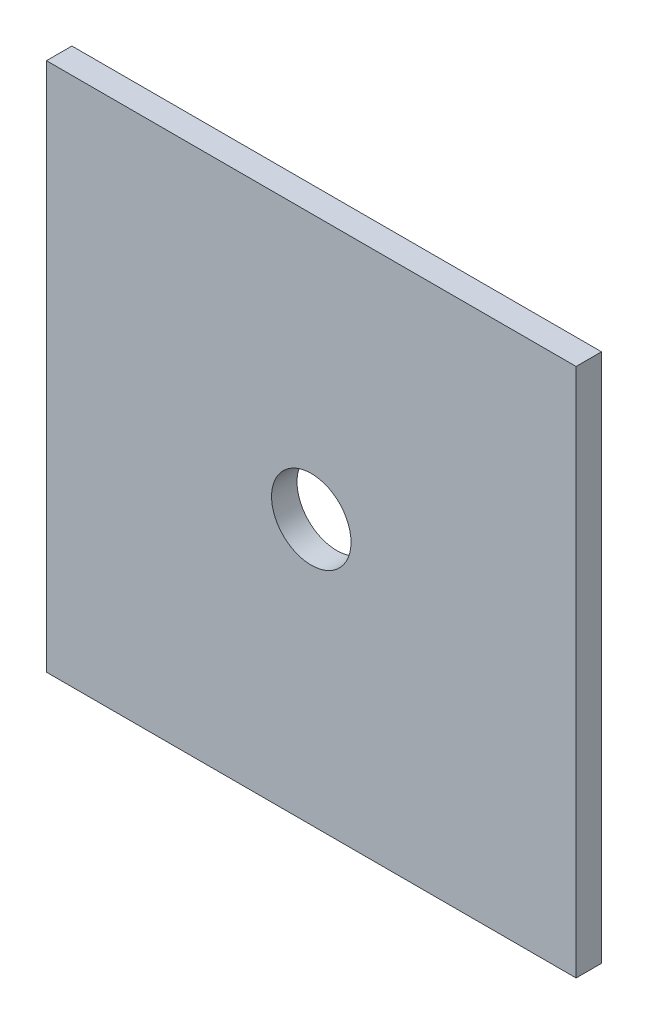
ISO-10303-21;
HEADER;
FILE_DESCRIPTION(('STEP AP214'),'2;1');
FILE_NAME('part.step','',(''),(''),'','','');
FILE_SCHEMA(('AUTOMOTIVE_DESIGN { 1 0 10303 214 1 1 1 1 }'));
ENDSEC;
DATA;
#1=APPLICATION_CONTEXT('core data for automotive mechanical design processes');
#2=APPLICATION_PROTOCOL_DEFINITION('international standard','automotive_design',2000,#1);
#3=PRODUCT_CONTEXT('',#1,'mechanical');
#4=PRODUCT('Part','Part','',(#3));
#5=PRODUCT_RELATED_PRODUCT_CATEGORY('part','',(#4));
#6=PRODUCT_DEFINITION_FORMATION('','',#4);
#7=PRODUCT_DEFINITION_CONTEXT('part definition',#1,'design');
#8=PRODUCT_DEFINITION('design','',#6,#7);
#9=PRODUCT_DEFINITION_SHAPE('','',#8);
#10=(LENGTH_UNIT() NAMED_UNIT(*) SI_UNIT(.MILLI.,.METRE.));
#11=(NAMED_UNIT(*) PLANE_ANGLE_UNIT() SI_UNIT($,.RADIAN.));
#12=(NAMED_UNIT(*) SI_UNIT($,.STERADIAN.) SOLID_ANGLE_UNIT());
#13=UNCERTAINTY_MEASURE_WITH_UNIT(LENGTH_MEASURE(1.E-05),#10,'distance_accuracy_value','');
#14=(GEOMETRIC_REPRESENTATION_CONTEXT(3) GLOBAL_UNCERTAINTY_ASSIGNED_CONTEXT((#13)) GLOBAL_UNIT_ASSIGNED_CONTEXT((#10,
#11,#12)) REPRESENTATION_CONTEXT('',''));
#15=CARTESIAN_POINT('',(0.,0.,0.));
#16=DIRECTION('',(0.,0.,1.));
#17=DIRECTION('',(1.,0.,0.));
#18=AXIS2_PLACEMENT_3D('',#15,#16,#17);
#19=CARTESIAN_POINT('',(0.,0.,-1.2192));
#20=DIRECTION('',(-1.,0.,0.));
#21=DIRECTION('',(0.,-1.,0.));
#22=AXIS2_PLACEMENT_3D('',#19,#20,#21);
#23=PLANE('',#22);
#24=DIRECTION('',(0.,-1.,0.));
#25=VECTOR('',#24,1.);
#26=CARTESIAN_POINT('',(0.,0.,0.));
#27=LINE('',#26,#25);
#28=CARTESIAN_POINT('',(0.,0.,0.));
#29=VERTEX_POINT('',#28);
#30=CARTESIAN_POINT('',(0.,-25.4,0.));
#31=VERTEX_POINT('',#30);
#32=EDGE_CURVE('E105',#29,#31,#27,.T.);
#33=ORIENTED_EDGE('',*,*,#32,.F.);
#34=DIRECTION('',(0.,0.,1.));
#35=VECTOR('',#34,1.);
#36=CARTESIAN_POINT('',(0.,0.,-1.2192));
#37=LINE('',#36,#35);
#38=CARTESIAN_POINT('',(0.,0.,-1.2192));
#39=VERTEX_POINT('',#38);
#40=EDGE_CURVE('E11',#39,#29,#37,.T.);
#41=ORIENTED_EDGE('',*,*,#40,.F.);
#42=DIRECTION('',(0.,-1.,0.));
#43=VECTOR('',#42,1.);
#44=CARTESIAN_POINT('',(0.,0.,-1.2192));
#45=LINE('',#44,#43);
#46=CARTESIAN_POINT('',(0.,-25.4,-1.2192));
#47=VERTEX_POINT('',#46);
#48=EDGE_CURVE('E98',#39,#47,#45,.T.);
#49=ORIENTED_EDGE('',*,*,#48,.T.);
#50=DIRECTION('',(0.,0.,1.));
#51=VECTOR('',#50,1.);
#52=CARTESIAN_POINT('',(0.,-25.4,-1.2192));
#53=LINE('',#52,#51);
#54=EDGE_CURVE('E43',#47,#31,#53,.T.);
#55=ORIENTED_EDGE('',*,*,#54,.T.);
#56=EDGE_LOOP('',(#33,#41,#49,#55));
#57=FACE_BOUND('',#56,.T.);
#58=ADVANCED_FACE('F40',(#57),#23,.T.);
#59=CARTESIAN_POINT('',(0.,0.,-1.2192));
#60=DIRECTION('',(0.,1.,0.));
#61=DIRECTION('',(0.,0.,1.));
#62=AXIS2_PLACEMENT_3D('',#59,#60,#61);
#63=PLANE('',#62);
#64=DIRECTION('',(-1.,0.,0.));
#65=VECTOR('',#64,1.);
#66=CARTESIAN_POINT('',(0.,0.,0.));
#67=LINE('',#66,#65);
#68=CARTESIAN_POINT('',(25.4,0.,0.));
#69=VERTEX_POINT('',#68);
#70=EDGE_CURVE('E100',#69,#29,#67,.T.);
#71=ORIENTED_EDGE('',*,*,#70,.F.);
#72=DIRECTION('',(0.,0.,1.));
#73=VECTOR('',#72,1.);
#74=CARTESIAN_POINT('',(25.4,0.,-1.2192));
#75=LINE('',#74,#73);
#76=CARTESIAN_POINT('',(25.4,0.,-1.2192));
#77=VERTEX_POINT('',#76);
#78=EDGE_CURVE('E49',#77,#69,#75,.T.);
#79=ORIENTED_EDGE('',*,*,#78,.F.);
#80=DIRECTION('',(-1.,0.,0.));
#81=VECTOR('',#80,1.);
#82=CARTESIAN_POINT('',(0.,0.,-1.2192));
#83=LINE('',#82,#81);
#84=EDGE_CURVE('E95',#77,#39,#83,.T.);
#85=ORIENTED_EDGE('',*,*,#84,.T.);
#86=ORIENTED_EDGE('',*,*,#40,.T.);
#87=EDGE_LOOP('',(#71,#79,#85,#86));
#88=FACE_BOUND('',#87,.T.);
#89=ADVANCED_FACE('F116',(#88),#63,.T.);
#90=CARTESIAN_POINT('',(25.4,0.,-1.2192));
#91=DIRECTION('',(1.,0.,0.));
#92=DIRECTION('',(0.,1.,0.));
#93=AXIS2_PLACEMENT_3D('',#90,#91,#92);
#94=PLANE('',#93);
#95=DIRECTION('',(0.,1.,0.));
#96=VECTOR('',#95,1.);
#97=CARTESIAN_POINT('',(25.4,0.,0.));
#98=LINE('',#97,#96);
#99=CARTESIAN_POINT('',(25.4,-25.4,0.));
#100=VERTEX_POINT('',#99);
#101=EDGE_CURVE('E90',#100,#69,#98,.T.);
#102=ORIENTED_EDGE('',*,*,#101,.F.);
#103=DIRECTION('',(0.,0.,1.));
#104=VECTOR('',#103,1.);
#105=CARTESIAN_POINT('',(25.4,-25.4,-1.2192));
#106=LINE('',#105,#104);
#107=CARTESIAN_POINT('',(25.4,-25.4,-1.2192));
#108=VERTEX_POINT('',#107);
#109=EDGE_CURVE('E85',#108,#100,#106,.T.);
#110=ORIENTED_EDGE('',*,*,#109,.F.);
#111=DIRECTION('',(0.,1.,0.));
#112=VECTOR('',#111,1.);
#113=CARTESIAN_POINT('',(25.4,0.,-1.2192));
#114=LINE('',#113,#112);
#115=EDGE_CURVE('E88',#108,#77,#114,.T.);
#116=ORIENTED_EDGE('',*,*,#115,.T.);
#117=ORIENTED_EDGE('',*,*,#78,.T.);
#118=EDGE_LOOP('',(#102,#110,#116,#117));
#119=FACE_BOUND('',#118,.T.);
#120=ADVANCED_FACE('F87',(#119),#94,.T.);
#121=CARTESIAN_POINT('',(0.,-25.4,-1.2192));
#122=DIRECTION('',(0.,-1.,0.));
#123=DIRECTION('',(0.,0.,-1.));
#124=AXIS2_PLACEMENT_3D('',#121,#122,#123);
#125=PLANE('',#124);
#126=DIRECTION('',(1.,0.,0.));
#127=VECTOR('',#126,1.);
#128=CARTESIAN_POINT('',(0.,-25.4,0.));
#129=LINE('',#128,#127);
#130=EDGE_CURVE('E108',#31,#100,#129,.T.);
#131=ORIENTED_EDGE('',*,*,#130,.F.);
#132=ORIENTED_EDGE('',*,*,#54,.F.);
#133=DIRECTION('',(1.,0.,0.));
#134=VECTOR('',#133,1.);
#135=CARTESIAN_POINT('',(0.,-25.4,-1.2192));
#136=LINE('',#135,#134);
#137=EDGE_CURVE('E94',#47,#108,#136,.T.);
#138=ORIENTED_EDGE('',*,*,#137,.T.);
#139=ORIENTED_EDGE('',*,*,#109,.T.);
#140=EDGE_LOOP('',(#131,#132,#138,#139));
#141=FACE_BOUND('',#140,.T.);
#142=ADVANCED_FACE('F97',(#141),#125,.T.);
#143=CARTESIAN_POINT('',(0.,0.,-1.2192));
#144=DIRECTION('',(0.,0.,1.));
#145=DIRECTION('',(1.,0.,0.));
#146=AXIS2_PLACEMENT_3D('',#143,#144,#145);
#147=PLANE('',#146);
#148=CARTESIAN_POINT('',(12.7,-12.7,-1.2192));
#149=DIRECTION('',(0.,0.,1.));
#150=DIRECTION('',(1.,0.,0.));
#151=AXIS2_PLACEMENT_3D('',#148,#149,#150);
#152=CIRCLE('',#151,1.905);
#153=CARTESIAN_POINT('',(14.605,-12.7,-1.2192));
#154=VERTEX_POINT('',#153);
#155=EDGE_CURVE('E109',#154,#154,#152,.T.);
#156=ORIENTED_EDGE('',*,*,#155,.T.);
#157=EDGE_LOOP('',(#156));
#158=FACE_BOUND('',#157,.T.);
#159=ORIENTED_EDGE('',*,*,#48,.F.);
#160=ORIENTED_EDGE('',*,*,#84,.F.);
#161=ORIENTED_EDGE('',*,*,#115,.F.);
#162=ORIENTED_EDGE('',*,*,#137,.F.);
#163=EDGE_LOOP('',(#159,#160,#161,#162));
#164=FACE_BOUND('',#163,.T.);
#165=ADVANCED_FACE('F93',(#158,#164),#147,.F.);
#166=CARTESIAN_POINT('',(0.,0.,0.));
#167=DIRECTION('',(0.,0.,1.));
#168=DIRECTION('',(1.,0.,0.));
#169=AXIS2_PLACEMENT_3D('',#166,#167,#168);
#170=PLANE('',#169);
#171=CARTESIAN_POINT('',(12.7,-12.7,0.));
#172=DIRECTION('',(0.,0.,1.));
#173=DIRECTION('',(1.,0.,0.));
#174=AXIS2_PLACEMENT_3D('',#171,#172,#173);
#175=CIRCLE('',#174,1.905);
#176=CARTESIAN_POINT('',(14.605,-12.7,0.));
#177=VERTEX_POINT('',#176);
#178=EDGE_CURVE('E145',#177,#177,#175,.T.);
#179=ORIENTED_EDGE('',*,*,#178,.F.);
#180=EDGE_LOOP('',(#179));
#181=FACE_BOUND('',#180,.T.);
#182=ORIENTED_EDGE('',*,*,#32,.T.);
#183=ORIENTED_EDGE('',*,*,#130,.T.);
#184=ORIENTED_EDGE('',*,*,#101,.T.);
#185=ORIENTED_EDGE('',*,*,#70,.T.);
#186=EDGE_LOOP('',(#182,#183,#184,#185));
#187=FACE_BOUND('',#186,.T.);
#188=ADVANCED_FACE('F115',(#181,#187),#170,.T.);
#189=CARTESIAN_POINT('',(12.7,-12.7,-2.54));
#190=DIRECTION('',(0.,0.,1.));
#191=DIRECTION('',(1.,0.,0.));
#192=AXIS2_PLACEMENT_3D('',#189,#190,#191);
#193=CYLINDRICAL_SURFACE('',#192,1.905);
#194=ORIENTED_EDGE('',*,*,#178,.T.);
#195=EDGE_LOOP('',(#194));
#196=FACE_BOUND('',#195,.T.);
#197=ORIENTED_EDGE('',*,*,#155,.F.);
#198=EDGE_LOOP('',(#197));
#199=FACE_BOUND('',#198,.T.);
#200=ADVANCED_FACE('F134',(#196,#199),#193,.F.);
#201=CLOSED_SHELL('',(#58,#89,#120,#142,#165,#188,#200));
#202=MANIFOLD_SOLID_BREP('B2',#201);
#203=ADVANCED_BREP_SHAPE_REPRESENTATION('',(#18,#202),#14);
#204=SHAPE_DEFINITION_REPRESENTATION(#9,#203);
ENDSEC;
END-ISO-10303-21;
